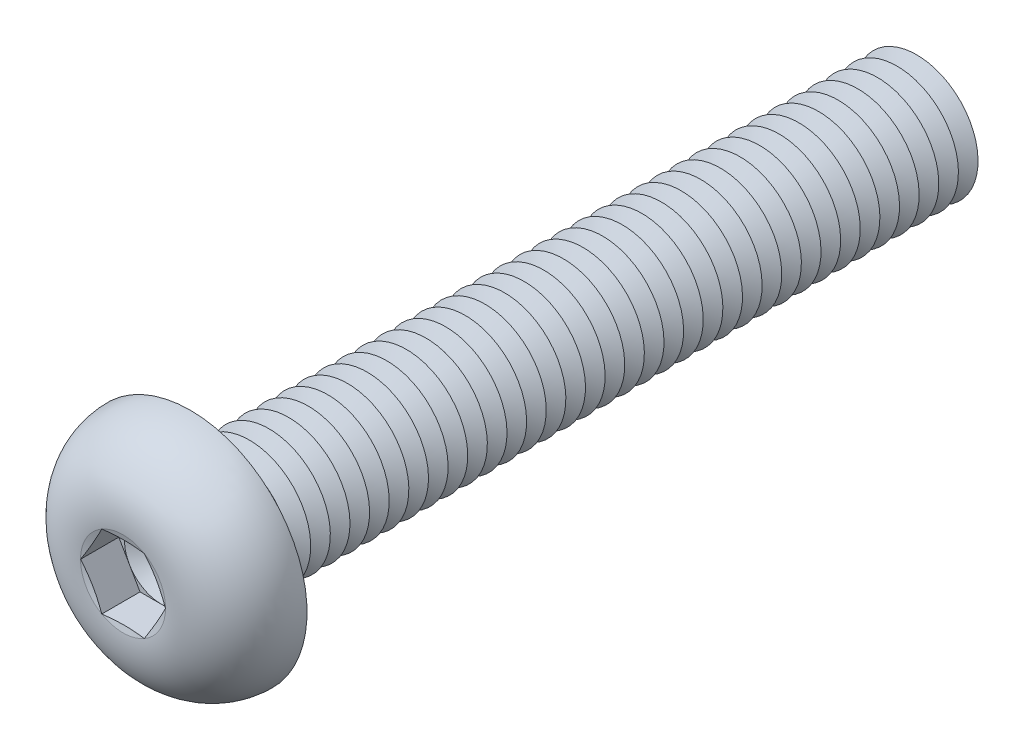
from build123d import *

# Parameters (mm, degrees)
FILLET1_R          = 0.4
LPATTERN1_COUNT    = 37
LPATTERN1_PITCH    = 0.8
CUT_EXTRUDE1_DEPTH = 1.56


with BuildPart() as part:
    # Sketch1 → Revolve1 (revolve)
    with BuildSketch(Plane(origin=(0, 0, 0), x_dir=(0, 0, -1), z_dir=(1, 0, 0))):
        with BuildLine():
            Line((0, 2.5), (0, 4.75))
            ThreePointArc((0, 4.75), (-2.041477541, 3.848329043), (-2.75, 1.73205))
            Line((-2.75, 1.73205), (-2.517949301, 0.866025))
            Line((-2.517949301, 0.866025), (-2.75, 0.866025))
            Line((-2.75, 0.866025), (-2.75, 0))
            Line((-2.75, 0), (30, 0))
            Line((30, 0), (30, 2.5))
            Line((30, 2.5), (0, 2.5))
        make_face()
    revolve(axis=Axis((0, 0, -30), (0, 0, 1)))

    # Fillet1
    fillet1_edges = [part.edges().sort_by_distance(p)[0] for p in [
        (0, -2.5, 0),
    ]]
    fillet(fillet1_edges, radius=FILLET1_R)

    # Sketch2 → Cut-Revolve1 (revolve, cut)
    with BuildSketch(Plane(origin=(0, 0, 0), x_dir=(0, 0, -1), z_dir=(1, 0, 0))):
        Polygon((29.6, 2.5), (30.4, 2.5), (30, 1.807179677), align=None)
    cut_revolve1 = revolve(axis=Axis((0, 0, -30), (0, 0, -1)), mode=Mode.SUBTRACT)

    # LPattern1: Cut-Revolve1 ×37
    with Locations(*[(0, 0, i * LPATTERN1_PITCH) for i in range(1, LPATTERN1_COUNT)]):
        add(cut_revolve1, mode=Mode.SUBTRACT)

    # Sketch3 → Cut-Extrude1 (cut)
    with BuildSketch(Plane.XY.offset(2.75)):
        Polygon((0.866025, 1.499999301), (-0.866025, 1.499999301), (-1.73205, 0), (-0.866025, -1.499999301), (0.866025, -1.499999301), (1.73205, 0), align=None)
    extrude(amount=-CUT_EXTRUDE1_DEPTH, mode=Mode.SUBTRACT)

    # Cut-Extrude2 cone 1 section (on through the dimple's axis) → Cut-Extrude2 (revolve, cut)
    with BuildSketch(Plane(origin=(0, 0, 1.19), x_dir=(0, -1, 0), z_dir=(1, 0, 0))):
        Polygon((0, 0), (1.499999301, 0), (0, 0.866025), align=None)
    revolve(axis=Axis((0, 0, 1.19), (0, 0, -1)), mode=Mode.SUBTRACT)


solid = part.part
